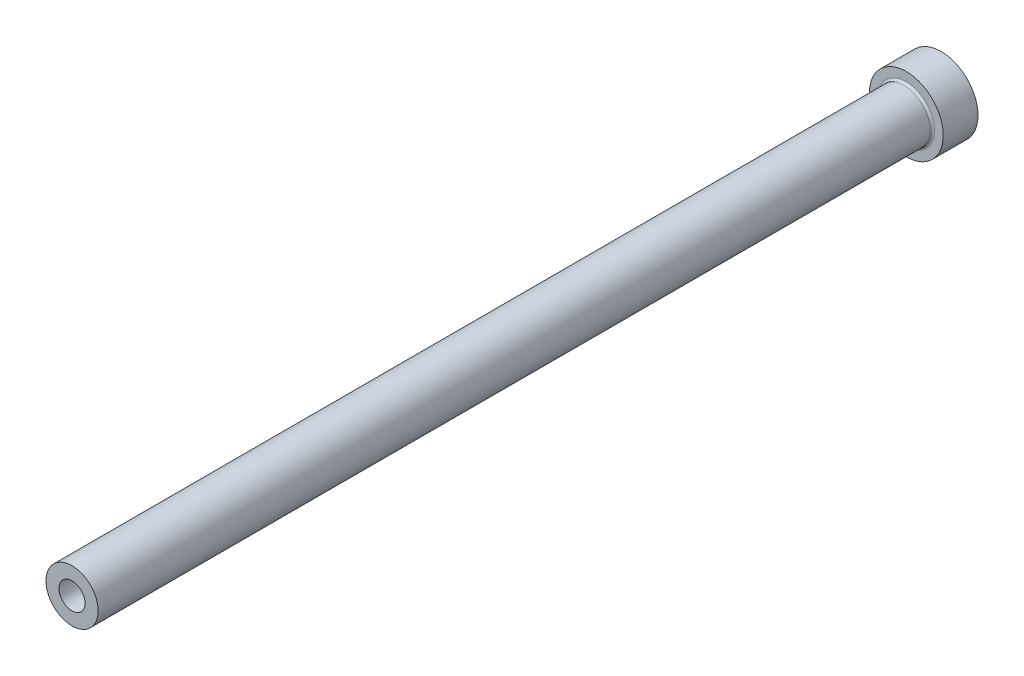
from build123d import *

# Parameters (mm, degrees)
HEAD_FILLET_R          = 0.5
ID_RELIEF_CHAMFER_SIZE = 0.5


with BuildPart() as part:
    # OD FV → Base Revolve (revolve)
    with BuildSketch(Plane(origin=(0, 0, 0), x_dir=(1, 0, 0), z_dir=(0, 1, 0))):
        Polygon((0, -200), (6, -200), (6, -8), (8.5, -8), (8.5, 0), (0, 0), align=None)
    revolve(axis=Axis((0, 0, 200), (0, 0, -1)))

    # ID FV → Hole (revolve, cut)
    with BuildSketch(Plane(origin=(0, 0, 0), x_dir=(1, 0, 0), z_dir=(0, 1, 0))):
        Polygon((0, -200), (3, -200), (3, -125), (3.25, -124.566987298), (3.25, 0), (0, 0), align=None)
    revolve(axis=Axis((0, 0, 200), (0, 0, -1)), mode=Mode.SUBTRACT)

    # Head Fillet
    head_fillet_edges = [part.edges().sort_by_distance(p)[0] for p in [
        (-6, 0, 8),
    ]]
    fillet(head_fillet_edges, radius=HEAD_FILLET_R)

    # ID Relief Chamfer
    id_relief_chamfer_edges = [part.edges().sort_by_distance(p)[0] for p in [
        (-3.25, 0, 0),
    ]]
    chamfer(id_relief_chamfer_edges, length=ID_RELIEF_CHAMFER_SIZE)


solid = part.part
